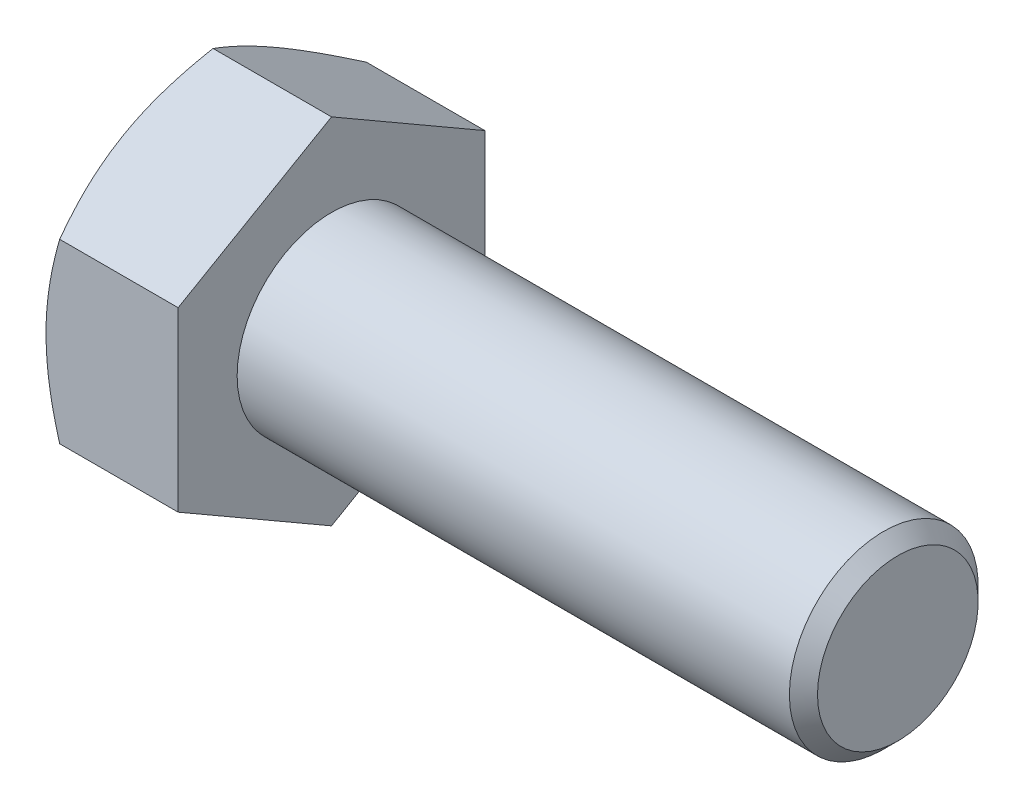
from build123d import *

# Parameters (mm, degrees)
BASEHEAD_DEPTH = 17.78


with BuildPart() as part:
    # Sketch1 → BaseHead (new body)
    with BuildSketch(Plane(origin=(0, 0, 0), x_dir=(0, 0, -1), z_dir=(1, 0, 0))):
        Polygon((20.6375, 11.91506618), (20.6375, -11.91506618), (0, -23.830132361), (-20.6375, -11.91506618), (-20.6375, 11.91506618), (0, 23.830132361), align=None)
    extrude(amount=BASEHEAD_DEPTH)

    # BodySke → BaseBody (revolve)
    with BuildSketch(Plane.XY, mode=Mode.PRIVATE) as basebody_sk:
        Polygon((0, 0), (93.98, 0), (93.98, 10.8077), (92.0877, 12.7), (0, 12.7), align=None)
    revolve(basebody_sk.sketch.rotate(Axis((0, 0, 0), (1, 0, 0)), 90), axis=Axis((0, 0, 0), (1, 0, 0)))

    # Sketch3 → HeadChamfer (revolve, cut)
    with BuildSketch(Plane.XY):
        Polygon((0, 20.6375), (5.509441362, 30.180132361), (5.509441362, 36.530132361), (-12.7, 36.530132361), (-12.7, 20.6375), align=None)
    revolve(axis=Axis((0, 0, 0), (1, 0, 0)), mode=Mode.SUBTRACT)


solid = part.part
